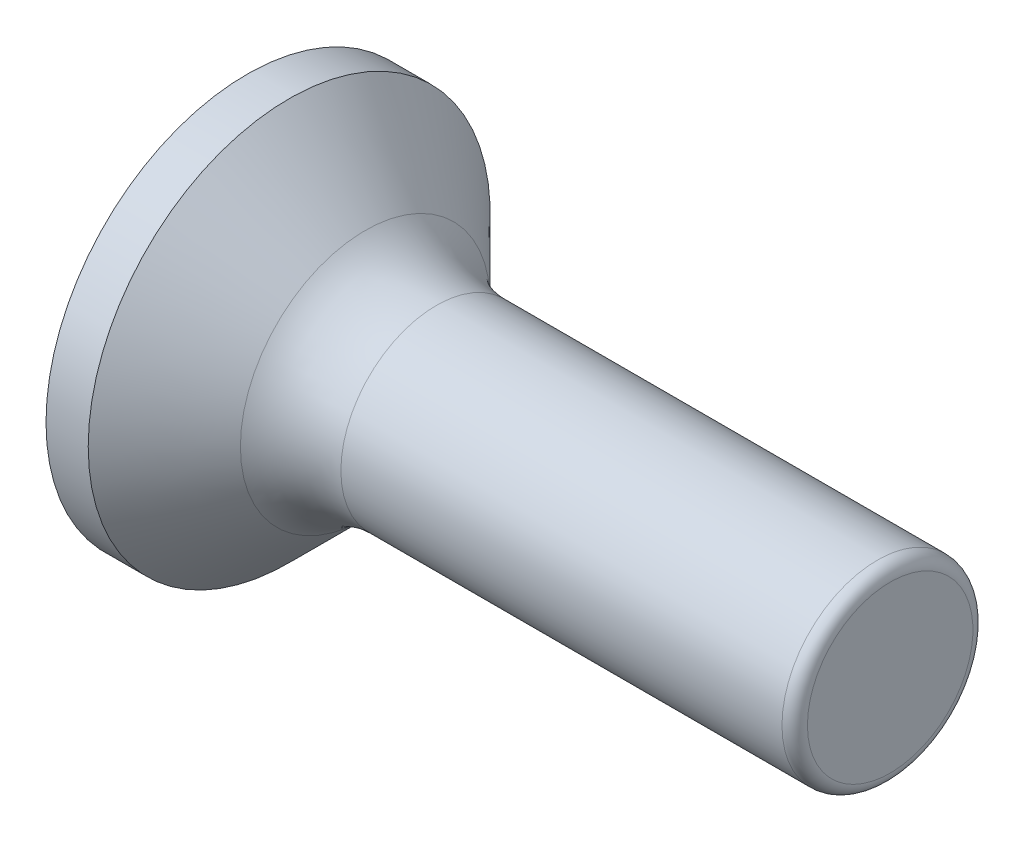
from build123d import *

# Parameters (mm, degrees)
CUT_EXTRUDE1_DEPTH = 2.942766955
DRAFT1_ANGLE       = 30
FILLET1_R          = 0.633333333


with BuildPart() as part:
    # Sketch1 → Base (revolve)
    with BuildSketch(Plane.XY, mode=Mode.PRIVATE) as base_sk:
        with BuildLine():
            Line((32, 0), (32, 4.75))
            Line((32, 4.75), (9.421067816, 4.75))
            ThreePointArc((9.421067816, 4.75), (7.507650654, 5.130602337), (5.88553391, 6.214466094))
            Line((5.88553391, 6.214466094), (2.100000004, 10))
            Line((2.100000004, 10), (0, 10))
            Line((0, 10), (0, 0))
            Line((0, 0), (32, 0))
        make_face()
    revolve(base_sk.sketch.rotate(Axis((-11.69614751, 0, 0), (1, 0, 0)), 90), axis=Axis((-11.69614751, 0, 0), (1, 0, 0)))

    # Sketch2 → Cut-Extrude1 (cut)
    with BuildSketch(Plane(origin=(0, 0, 0), x_dir=(0, 0, -1), z_dir=(1, 0, 0))):
        Polygon((1, 5), (-1, 5), (-1, 1), (-5, 1), (-5, -1), (-1, -1), (-1, -5), (1, -5), (1, -1), (5, -1), (5, 1), (1, 1), align=None)
    extrude(amount=CUT_EXTRUDE1_DEPTH, mode=Mode.SUBTRACT)

    # Draft1
    draft1_faces = [part.faces().sort_by_distance(p)[0] for p in [
        (1.471383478, 0, -5),
        (1.471383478, 0, 5),
        (1.471383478, -5, 0),
        (1.471383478, 5, 0),
    ]]
    draft(draft1_faces, Plane(origin=(0, 10, 0), x_dir=(0, 0, -1), z_dir=(-1, 0, 0)), DRAFT1_ANGLE)

    # Fillet1
    fillet1_edges = [part.edges().sort_by_distance(p)[0] for p in [
        (32, 0, -4.75),
    ]]
    fillet(fillet1_edges, radius=FILLET1_R)


solid = part.part
